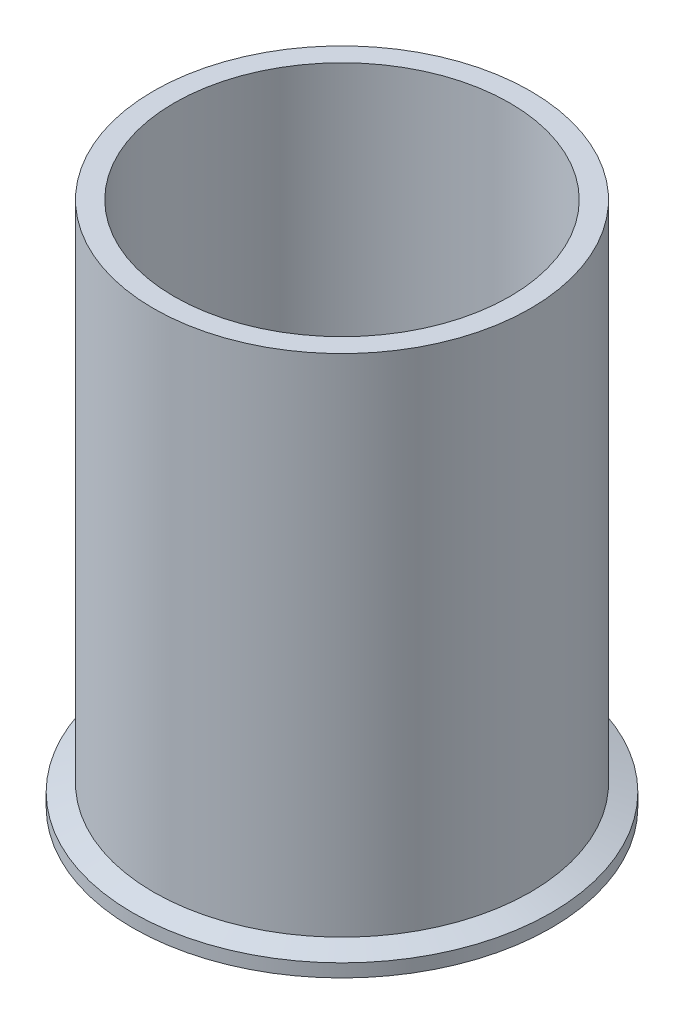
ISO-10303-21;
HEADER;
FILE_DESCRIPTION(('STEP AP214'),'2;1');
FILE_NAME('part.step','',(''),(''),'','','');
FILE_SCHEMA(('AUTOMOTIVE_DESIGN { 1 0 10303 214 1 1 1 1 }'));
ENDSEC;
DATA;
#1=APPLICATION_CONTEXT('core data for automotive mechanical design processes');
#2=APPLICATION_PROTOCOL_DEFINITION('international standard','automotive_design',2000,#1);
#3=PRODUCT_CONTEXT('',#1,'mechanical');
#4=PRODUCT('Part','Part','',(#3));
#5=PRODUCT_RELATED_PRODUCT_CATEGORY('part','',(#4));
#6=PRODUCT_DEFINITION_FORMATION('','',#4);
#7=PRODUCT_DEFINITION_CONTEXT('part definition',#1,'design');
#8=PRODUCT_DEFINITION('design','',#6,#7);
#9=PRODUCT_DEFINITION_SHAPE('','',#8);
#10=(LENGTH_UNIT() NAMED_UNIT(*) SI_UNIT(.MILLI.,.METRE.));
#11=(NAMED_UNIT(*) PLANE_ANGLE_UNIT() SI_UNIT($,.RADIAN.));
#12=(NAMED_UNIT(*) SI_UNIT($,.STERADIAN.) SOLID_ANGLE_UNIT());
#13=UNCERTAINTY_MEASURE_WITH_UNIT(LENGTH_MEASURE(1.E-05),#10,'distance_accuracy_value','');
#14=(GEOMETRIC_REPRESENTATION_CONTEXT(3) GLOBAL_UNCERTAINTY_ASSIGNED_CONTEXT((#13)) GLOBAL_UNIT_ASSIGNED_CONTEXT((#10,
#11,#12)) REPRESENTATION_CONTEXT('',''));
#15=CARTESIAN_POINT('',(0.,0.,0.));
#16=DIRECTION('',(0.,0.,1.));
#17=DIRECTION('',(1.,0.,0.));
#18=AXIS2_PLACEMENT_3D('',#15,#16,#17);
#19=CARTESIAN_POINT('',(0.,0.7874,0.));
#20=DIRECTION('',(0.,-1.,0.));
#21=DIRECTION('',(0.,0.,-1.));
#22=AXIS2_PLACEMENT_3D('',#19,#20,#21);
#23=TOROIDAL_SURFACE('',#22,43.4867084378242,0.787400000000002);
#24=CARTESIAN_POINT('',(0.,0.,0.));
#25=DIRECTION('',(0.,-1.,0.));
#26=DIRECTION('',(0.,0.,-1.));
#27=AXIS2_PLACEMENT_3D('',#24,#25,#26);
#28=CIRCLE('',#27,43.4867084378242);
#29=CARTESIAN_POINT('',(0.,0.,-43.4867084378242));
#30=VERTEX_POINT('',#29);
#31=EDGE_CURVE('E67',#30,#30,#28,.T.);
#32=ORIENTED_EDGE('',*,*,#31,.T.);
#33=EDGE_LOOP('',(#32));
#34=FACE_BOUND('',#33,.T.);
#35=CARTESIAN_POINT('',(0.,0.474458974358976,0.));
#36=DIRECTION('',(0.,-1.,0.));
#37=DIRECTION('',(0.,0.,-1.));
#38=AXIS2_PLACEMENT_3D('',#35,#36,#37);
#39=CIRCLE('',#38,42.7641666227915);
#40=CARTESIAN_POINT('',(0.,0.474458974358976,-42.7641666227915));
#41=VERTEX_POINT('',#40);
#42=EDGE_CURVE('E10',#41,#41,#39,.T.);
#43=ORIENTED_EDGE('',*,*,#42,.F.);
#44=EDGE_LOOP('',(#43));
#45=FACE_BOUND('',#44,.T.);
#46=ADVANCED_FACE('F33',(#34,#45),#23,.T.);
#47=CARTESIAN_POINT('',(0.,0.,0.));
#48=DIRECTION('',(0.,-1.,0.));
#49=DIRECTION('',(0.,0.,-1.));
#50=AXIS2_PLACEMENT_3D('',#47,#48,#49);
#51=TOROIDAL_SURFACE('',#50,41.6687,1.1938);
#52=CARTESIAN_POINT('',(0.,0.474458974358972,0.));
#53=DIRECTION('',(0.,-1.,0.));
#54=DIRECTION('',(0.,0.,-1.));
#55=AXIS2_PLACEMENT_3D('',#52,#53,#54);
#56=CIRCLE('',#55,40.5732333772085);
#57=CARTESIAN_POINT('',(0.,0.474458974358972,-40.5732333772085));
#58=VERTEX_POINT('',#57);
#59=EDGE_CURVE('E39',#58,#58,#56,.T.);
#60=ORIENTED_EDGE('',*,*,#59,.F.);
#61=EDGE_LOOP('',(#60));
#62=FACE_BOUND('',#61,.T.);
#63=ORIENTED_EDGE('',*,*,#42,.T.);
#64=EDGE_LOOP('',(#63));
#65=FACE_BOUND('',#64,.T.);
#66=ADVANCED_FACE('F115',(#62,#65),#51,.F.);
#67=CARTESIAN_POINT('',(0.,0.7874,0.));
#68=DIRECTION('',(0.,-1.,0.));
#69=DIRECTION('',(0.,0.,-1.));
#70=AXIS2_PLACEMENT_3D('',#67,#68,#69);
#71=TOROIDAL_SURFACE('',#70,39.8506915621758,0.787399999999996);
#72=ORIENTED_EDGE('',*,*,#59,.T.);
#73=EDGE_LOOP('',(#72));
#74=FACE_BOUND('',#73,.T.);
#75=CARTESIAN_POINT('',(0.,0.,0.));
#76=DIRECTION('',(0.,-1.,0.));
#77=DIRECTION('',(0.,0.,-1.));
#78=AXIS2_PLACEMENT_3D('',#75,#76,#77);
#79=CIRCLE('',#78,39.8506915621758);
#80=CARTESIAN_POINT('',(0.,0.,-39.8506915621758));
#81=VERTEX_POINT('',#80);
#82=EDGE_CURVE('E43',#81,#81,#79,.T.);
#83=ORIENTED_EDGE('',*,*,#82,.F.);
#84=EDGE_LOOP('',(#83));
#85=FACE_BOUND('',#84,.T.);
#86=ADVANCED_FACE('F111',(#74,#85),#71,.T.);
#87=CARTESIAN_POINT('',(0.,0.,0.));
#88=DIRECTION('',(0.,1.,0.));
#89=DIRECTION('',(0.,0.,1.));
#90=AXIS2_PLACEMENT_3D('',#87,#88,#89);
#91=PLANE('',#90);
#92=CARTESIAN_POINT('',(0.,0.,0.));
#93=DIRECTION('',(0.,-1.,0.));
#94=DIRECTION('',(0.,0.,-1.));
#95=AXIS2_PLACEMENT_3D('',#92,#93,#94);
#96=CIRCLE('',#95,36.449);
#97=CARTESIAN_POINT('',(0.,0.,-36.449));
#98=VERTEX_POINT('',#97);
#99=EDGE_CURVE('E47',#98,#98,#96,.T.);
#100=ORIENTED_EDGE('',*,*,#99,.F.);
#101=EDGE_LOOP('',(#100));
#102=FACE_BOUND('',#101,.T.);
#103=ORIENTED_EDGE('',*,*,#82,.T.);
#104=EDGE_LOOP('',(#103));
#105=FACE_BOUND('',#104,.T.);
#106=ADVANCED_FACE('F105',(#102,#105),#91,.F.);
#107=CARTESIAN_POINT('',(0.,0.,0.));
#108=DIRECTION('',(0.,-1.,0.));
#109=DIRECTION('',(0.,0.,-1.));
#110=AXIS2_PLACEMENT_3D('',#107,#108,#109);
#111=CYLINDRICAL_SURFACE('',#110,36.449);
#112=ORIENTED_EDGE('',*,*,#99,.T.);
#113=EDGE_LOOP('',(#112));
#114=FACE_BOUND('',#113,.T.);
#115=CARTESIAN_POINT('',(0.,114.3,0.));
#116=DIRECTION('',(0.,-1.,0.));
#117=DIRECTION('',(0.,0.,-1.));
#118=AXIS2_PLACEMENT_3D('',#115,#116,#117);
#119=CIRCLE('',#118,36.449);
#120=CARTESIAN_POINT('',(0.,114.3,-36.449));
#121=VERTEX_POINT('',#120);
#122=EDGE_CURVE('E52',#121,#121,#119,.T.);
#123=ORIENTED_EDGE('',*,*,#122,.F.);
#124=EDGE_LOOP('',(#123));
#125=FACE_BOUND('',#124,.T.);
#126=ADVANCED_FACE('F100',(#114,#125),#111,.F.);
#127=CARTESIAN_POINT('',(0.,114.3,0.));
#128=DIRECTION('',(0.,-1.,0.));
#129=DIRECTION('',(0.,0.,-1.));
#130=AXIS2_PLACEMENT_3D('',#127,#128,#129);
#131=PLANE('',#130);
#132=CARTESIAN_POINT('',(0.,114.3,0.));
#133=DIRECTION('',(0.,-1.,0.));
#134=DIRECTION('',(0.,0.,-1.));
#135=AXIS2_PLACEMENT_3D('',#132,#133,#134);
#136=CIRCLE('',#135,40.9448);
#137=CARTESIAN_POINT('',(0.,114.3,-40.9448));
#138=VERTEX_POINT('',#137);
#139=EDGE_CURVE('E55',#138,#138,#136,.T.);
#140=ORIENTED_EDGE('',*,*,#139,.F.);
#141=EDGE_LOOP('',(#140));
#142=FACE_BOUND('',#141,.T.);
#143=ORIENTED_EDGE('',*,*,#122,.T.);
#144=EDGE_LOOP('',(#143));
#145=FACE_BOUND('',#144,.T.);
#146=ADVANCED_FACE('F94',(#142,#145),#131,.F.);
#147=CARTESIAN_POINT('',(0.,0.,0.));
#148=DIRECTION('',(0.,-1.,0.));
#149=DIRECTION('',(0.,0.,-1.));
#150=AXIS2_PLACEMENT_3D('',#147,#148,#149);
#151=CYLINDRICAL_SURFACE('',#150,40.9448);
#152=CARTESIAN_POINT('',(0.,4.48575980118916,0.));
#153=DIRECTION('',(0.,-1.,0.));
#154=DIRECTION('',(0.,0.,-1.));
#155=AXIS2_PLACEMENT_3D('',#152,#153,#154);
#156=CIRCLE('',#155,40.9448);
#157=CARTESIAN_POINT('',(0.,4.48575980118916,-40.9448));
#158=VERTEX_POINT('',#157);
#159=EDGE_CURVE('E58',#158,#158,#156,.T.);
#160=ORIENTED_EDGE('',*,*,#159,.F.);
#161=EDGE_LOOP('',(#160));
#162=FACE_BOUND('',#161,.T.);
#163=ORIENTED_EDGE('',*,*,#139,.T.);
#164=EDGE_LOOP('',(#163));
#165=FACE_BOUND('',#164,.T.);
#166=ADVANCED_FACE('F88',(#162,#165),#151,.T.);
#167=CARTESIAN_POINT('',(0.,4.48575980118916,0.));
#168=DIRECTION('',(0.,-1.,0.));
#169=DIRECTION('',(0.,0.,-1.));
#170=AXIS2_PLACEMENT_3D('',#167,#168,#169);
#171=CONICAL_SURFACE('',#170,40.9448,1.22173047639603);
#172=CARTESIAN_POINT('',(0.,2.8448,0.));
#173=DIRECTION('',(0.,-1.,0.));
#174=DIRECTION('',(0.,0.,-1.));
#175=AXIS2_PLACEMENT_3D('',#172,#173,#174);
#176=CIRCLE('',#175,45.4533);
#177=CARTESIAN_POINT('',(0.,2.8448,-45.4533));
#178=VERTEX_POINT('',#177);
#179=EDGE_CURVE('E61',#178,#178,#176,.T.);
#180=ORIENTED_EDGE('',*,*,#179,.F.);
#181=EDGE_LOOP('',(#180));
#182=FACE_BOUND('',#181,.T.);
#183=ORIENTED_EDGE('',*,*,#159,.T.);
#184=EDGE_LOOP('',(#183));
#185=FACE_BOUND('',#184,.T.);
#186=ADVANCED_FACE('F82',(#182,#185),#171,.T.);
#187=CARTESIAN_POINT('',(0.,0.,0.));
#188=DIRECTION('',(0.,-1.,0.));
#189=DIRECTION('',(0.,0.,-1.));
#190=AXIS2_PLACEMENT_3D('',#187,#188,#189);
#191=CYLINDRICAL_SURFACE('',#190,45.4533);
#192=CARTESIAN_POINT('',(0.,0.,0.));
#193=DIRECTION('',(0.,-1.,0.));
#194=DIRECTION('',(0.,0.,-1.));
#195=AXIS2_PLACEMENT_3D('',#192,#193,#194);
#196=CIRCLE('',#195,45.4533);
#197=CARTESIAN_POINT('',(0.,0.,-45.4533));
#198=VERTEX_POINT('',#197);
#199=EDGE_CURVE('E64',#198,#198,#196,.T.);
#200=ORIENTED_EDGE('',*,*,#199,.F.);
#201=EDGE_LOOP('',(#200));
#202=FACE_BOUND('',#201,.T.);
#203=ORIENTED_EDGE('',*,*,#179,.T.);
#204=EDGE_LOOP('',(#203));
#205=FACE_BOUND('',#204,.T.);
#206=ADVANCED_FACE('F76',(#202,#205),#191,.T.);
#207=CARTESIAN_POINT('',(0.,0.,0.));
#208=DIRECTION('',(0.,1.,0.));
#209=DIRECTION('',(0.,0.,1.));
#210=AXIS2_PLACEMENT_3D('',#207,#208,#209);
#211=PLANE('',#210);
#212=ORIENTED_EDGE('',*,*,#31,.F.);
#213=EDGE_LOOP('',(#212));
#214=FACE_BOUND('',#213,.T.);
#215=ORIENTED_EDGE('',*,*,#199,.T.);
#216=EDGE_LOOP('',(#215));
#217=FACE_BOUND('',#216,.T.);
#218=ADVANCED_FACE('F73',(#214,#217),#211,.F.);
#219=CLOSED_SHELL('',(#46,#66,#86,#106,#126,#146,#166,#186,#206,#218));
#220=MANIFOLD_SOLID_BREP('B2',#219);
#221=ADVANCED_BREP_SHAPE_REPRESENTATION('',(#18,#220),#14);
#222=SHAPE_DEFINITION_REPRESENTATION(#9,#221);
ENDSEC;
END-ISO-10303-21;
